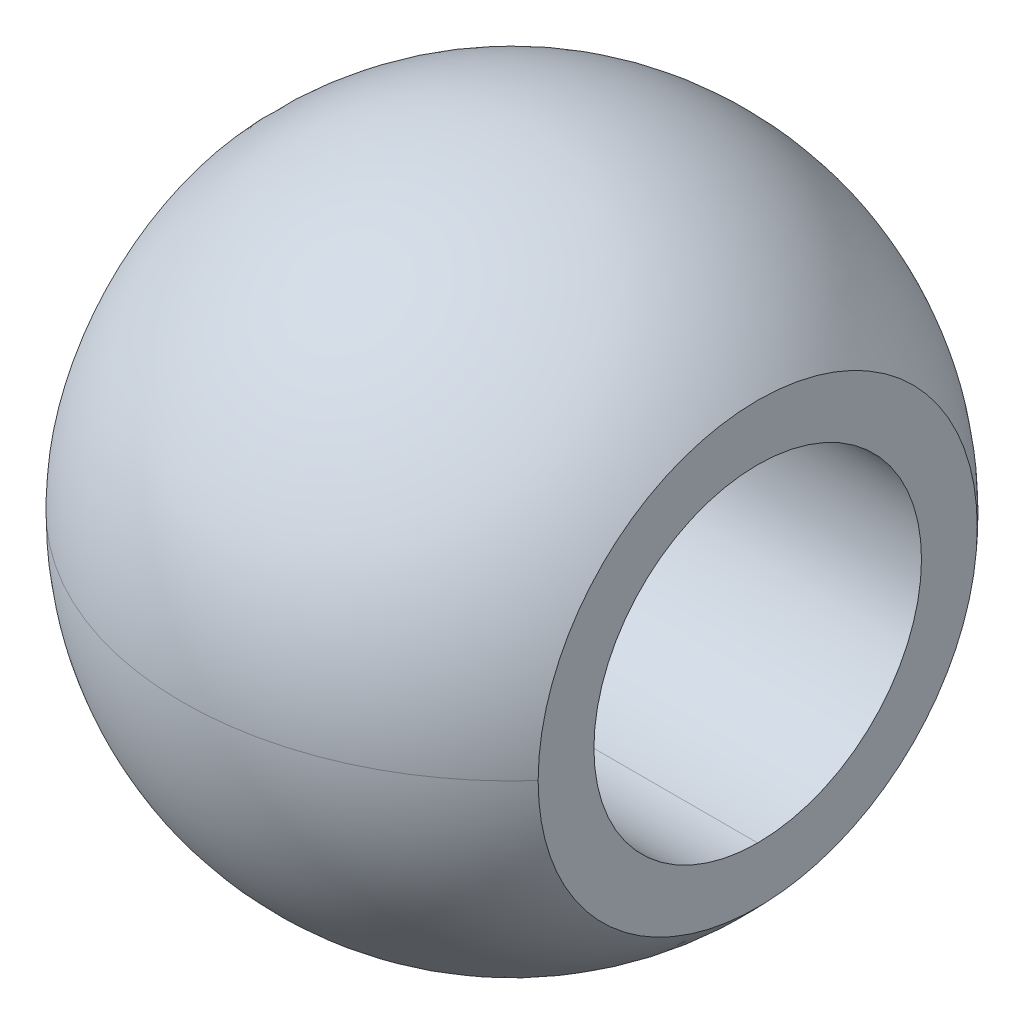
ISO-10303-21;
HEADER;
FILE_DESCRIPTION(('STEP AP214'),'2;1');
FILE_NAME('part.step','',(''),(''),'','','');
FILE_SCHEMA(('AUTOMOTIVE_DESIGN { 1 0 10303 214 1 1 1 1 }'));
ENDSEC;
DATA;
#1=APPLICATION_CONTEXT('core data for automotive mechanical design processes');
#2=APPLICATION_PROTOCOL_DEFINITION('international standard','automotive_design',2000,#1);
#3=PRODUCT_CONTEXT('',#1,'mechanical');
#4=PRODUCT('Part','Part','',(#3));
#5=PRODUCT_RELATED_PRODUCT_CATEGORY('part','',(#4));
#6=PRODUCT_DEFINITION_FORMATION('','',#4);
#7=PRODUCT_DEFINITION_CONTEXT('part definition',#1,'design');
#8=PRODUCT_DEFINITION('design','',#6,#7);
#9=PRODUCT_DEFINITION_SHAPE('','',#8);
#10=(LENGTH_UNIT() NAMED_UNIT(*) SI_UNIT(.MILLI.,.METRE.));
#11=(NAMED_UNIT(*) PLANE_ANGLE_UNIT() SI_UNIT($,.RADIAN.));
#12=(NAMED_UNIT(*) SI_UNIT($,.STERADIAN.) SOLID_ANGLE_UNIT());
#13=UNCERTAINTY_MEASURE_WITH_UNIT(LENGTH_MEASURE(1.E-05),#10,'distance_accuracy_value','');
#14=(GEOMETRIC_REPRESENTATION_CONTEXT(3) GLOBAL_UNCERTAINTY_ASSIGNED_CONTEXT((#13)) GLOBAL_UNIT_ASSIGNED_CONTEXT((#10,
#11,#12)) REPRESENTATION_CONTEXT('',''));
#15=CARTESIAN_POINT('',(0.,0.,0.));
#16=DIRECTION('',(0.,0.,1.));
#17=DIRECTION('',(1.,0.,0.));
#18=AXIS2_PLACEMENT_3D('',#15,#16,#17);
#19=CARTESIAN_POINT('',(0.,0.,0.));
#20=DIRECTION('',(-1.,0.,0.));
#21=DIRECTION('',(0.,0.,1.));
#22=AXIS2_PLACEMENT_3D('',#19,#20,#21);
#23=CYLINDRICAL_SURFACE('',#22,3.);
#24=CARTESIAN_POINT('',(-4.5,0.,0.));
#25=DIRECTION('',(-1.,0.,0.));
#26=DIRECTION('',(0.,0.,1.));
#27=AXIS2_PLACEMENT_3D('',#24,#25,#26);
#28=CIRCLE('',#27,3.);
#29=CARTESIAN_POINT('',(-4.5,3.,0.));
#30=VERTEX_POINT('',#29);
#31=CARTESIAN_POINT('',(-4.5,-3.,0.));
#32=VERTEX_POINT('',#31);
#33=EDGE_CURVE('E68',#30,#32,#28,.T.);
#34=ORIENTED_EDGE('',*,*,#33,.T.);
#35=DIRECTION('',(-1.,0.,0.));
#36=VECTOR('',#35,1.);
#37=CARTESIAN_POINT('',(0.,-3.,0.));
#38=LINE('',#37,#36);
#39=CARTESIAN_POINT('',(4.5,-3.,0.));
#40=VERTEX_POINT('',#39);
#41=EDGE_CURVE('E63',#32,#40,#38,.F.);
#42=ORIENTED_EDGE('',*,*,#41,.T.);
#43=CARTESIAN_POINT('',(4.5,0.,0.));
#44=DIRECTION('',(-1.,0.,0.));
#45=DIRECTION('',(0.,0.,1.));
#46=AXIS2_PLACEMENT_3D('',#43,#44,#45);
#47=CIRCLE('',#46,3.);
#48=CARTESIAN_POINT('',(4.5,3.,0.));
#49=VERTEX_POINT('',#48);
#50=EDGE_CURVE('E65',#40,#49,#47,.F.);
#51=ORIENTED_EDGE('',*,*,#50,.T.);
#52=DIRECTION('',(-1.,0.,0.));
#53=VECTOR('',#52,1.);
#54=CARTESIAN_POINT('',(0.,3.,0.));
#55=LINE('',#54,#53);
#56=EDGE_CURVE('E58',#49,#30,#55,.T.);
#57=ORIENTED_EDGE('',*,*,#56,.T.);
#58=EDGE_LOOP('',(#34,#42,#51,#57));
#59=FACE_BOUND('',#58,.T.);
#60=ADVANCED_FACE('F14',(#59),#23,.F.);
#61=CARTESIAN_POINT('',(0.,0.,0.));
#62=DIRECTION('',(-1.,0.,0.));
#63=DIRECTION('',(0.,0.,1.));
#64=AXIS2_PLACEMENT_3D('',#61,#62,#63);
#65=CYLINDRICAL_SURFACE('',#64,3.);
#66=CARTESIAN_POINT('',(4.5,0.,0.));
#67=DIRECTION('',(-1.,0.,0.));
#68=DIRECTION('',(0.,0.,1.));
#69=AXIS2_PLACEMENT_3D('',#66,#67,#68);
#70=CIRCLE('',#69,3.);
#71=EDGE_CURVE('E17',#49,#40,#70,.F.);
#72=ORIENTED_EDGE('',*,*,#71,.T.);
#73=ORIENTED_EDGE('',*,*,#41,.F.);
#74=CARTESIAN_POINT('',(-4.5,0.,0.));
#75=DIRECTION('',(-1.,0.,0.));
#76=DIRECTION('',(0.,0.,1.));
#77=AXIS2_PLACEMENT_3D('',#74,#75,#76);
#78=CIRCLE('',#77,3.);
#79=EDGE_CURVE('E154',#32,#30,#78,.T.);
#80=ORIENTED_EDGE('',*,*,#79,.T.);
#81=ORIENTED_EDGE('',*,*,#56,.F.);
#82=EDGE_LOOP('',(#72,#73,#80,#81));
#83=FACE_BOUND('',#82,.T.);
#84=ADVANCED_FACE('F71',(#83),#65,.F.);
#85=CARTESIAN_POINT('',(4.5,12.07,-12.07));
#86=DIRECTION('',(-1.,0.,0.));
#87=DIRECTION('',(0.,0.,1.));
#88=AXIS2_PLACEMENT_3D('',#85,#86,#87);
#89=PLANE('',#88);
#90=CARTESIAN_POINT('',(4.5,0.,4.02134616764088));
#91=CARTESIAN_POINT('',(4.5,0.11310688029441,4.02135700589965));
#92=CARTESIAN_POINT('',(4.5,0.22620862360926,4.01657423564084));
#93=CARTESIAN_POINT('',(4.5,0.451602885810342,3.99750534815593));
#94=CARTESIAN_POINT('',(4.5,0.563895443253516,3.98321968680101));
#95=CARTESIAN_POINT('',(4.5,0.786799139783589,3.94524322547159));
#96=CARTESIAN_POINT('',(4.5,0.89741148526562,3.92155954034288));
#97=CARTESIAN_POINT('',(4.5,1.11622089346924,3.86497914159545));
#98=CARTESIAN_POINT('',(4.5,1.22441798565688,3.83208254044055));
#99=CARTESIAN_POINT('',(4.5,1.54434242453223,3.71983911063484));
#100=CARTESIAN_POINT('',(4.5,1.75149364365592,3.6269231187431));
#101=CARTESIAN_POINT('',(4.5,2.14710423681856,3.40769375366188));
#102=CARTESIAN_POINT('',(4.5,2.33556689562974,3.28138626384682));
#103=CARTESIAN_POINT('',(4.5,2.68864347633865,2.99891708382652));
#104=CARTESIAN_POINT('',(4.5,2.85325763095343,2.84275568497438));
#105=CARTESIAN_POINT('',(4.5,3.15395693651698,2.50497964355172));
#106=CARTESIAN_POINT('',(4.5,3.29003650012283,2.32336002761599));
#107=CARTESIAN_POINT('',(4.5,3.52979320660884,1.93983393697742));
#108=CARTESIAN_POINT('',(4.5,3.63346400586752,1.73792350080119));
#109=CARTESIAN_POINT('',(4.5,3.80538192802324,1.31960348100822));
#110=CARTESIAN_POINT('',(4.5,3.87364979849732,1.10320247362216));
#111=CARTESIAN_POINT('',(4.5,3.95585906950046,0.737897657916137));
#112=CARTESIAN_POINT('',(4.5,3.98040189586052,0.591291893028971));
#113=CARTESIAN_POINT('',(4.5,4.0131432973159,0.296477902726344));
#114=CARTESIAN_POINT('',(4.5,4.02136504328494,0.148272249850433));
#115=CARTESIAN_POINT('',(4.5,4.02134616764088,0.));
#116=B_SPLINE_CURVE_WITH_KNOTS('',3,(#90,#91,#92,#93,#94,#95,#96,#97,#98,#99,#100,#101,#102,
#103,#104,#105,#106,#107,#108,#109,#110,#111,#112,#113,#114,#115),.UNSPECIFIED.,.F.,.F.,(4,2,2,
2,2,2,2,2,2,2,2,2,4),(0.,0.339210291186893,0.678404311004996,1.01734202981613,1.35627561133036,
2.03387015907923,2.7113453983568,3.38881402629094,4.06641518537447,4.74414889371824,
5.42148497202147,5.86657662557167,6.31103593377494),.UNSPECIFIED.);
#117=CARTESIAN_POINT('',(4.5,0.,4.02134616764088));
#118=VERTEX_POINT('',#117);
#119=CARTESIAN_POINT('',(4.5,4.02134616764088,0.));
#120=VERTEX_POINT('',#119);
#121=EDGE_CURVE('E74',#118,#120,#116,.T.);
#122=ORIENTED_EDGE('',*,*,#121,.F.);
#123=CARTESIAN_POINT('',(4.5,-9.22005527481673E-13,-4.02134616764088));
#124=CARTESIAN_POINT('',(4.5,-0.113101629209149,-4.02135832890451));
#125=CARTESIAN_POINT('',(4.5,-0.226201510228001,-4.01657515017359));
#126=CARTESIAN_POINT('',(4.5,-0.451592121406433,-3.99750594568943));
#127=CARTESIAN_POINT('',(4.5,-0.56388289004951,-3.98322037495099));
#128=CARTESIAN_POINT('',(4.5,-0.786782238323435,-3.94524755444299));
#129=CARTESIAN_POINT('',(4.5,-0.897391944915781,-3.92156692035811));
#130=CARTESIAN_POINT('',(4.5,-1.11622307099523,-3.86497625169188));
#131=CARTESIAN_POINT('',(4.5,-1.22444451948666,-3.83206632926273));
#132=CARTESIAN_POINT('',(4.5,-1.43776215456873,-3.75723901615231));
#133=CARTESIAN_POINT('',(4.5,-1.5428574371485,-3.7153190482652));
#134=CARTESIAN_POINT('',(4.5,-1.74918151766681,-3.62275832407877));
#135=CARTESIAN_POINT('',(4.5,-1.85040887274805,-3.57211435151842));
#136=CARTESIAN_POINT('',(4.5,-2.04817993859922,-3.46250754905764));
#137=CARTESIAN_POINT('',(4.5,-2.14472626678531,-3.40354944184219));
#138=CARTESIAN_POINT('',(4.5,-2.33254527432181,-3.27768843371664));
#139=CARTESIAN_POINT('',(4.5,-2.42381599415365,-3.21078260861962));
#140=CARTESIAN_POINT('',(4.5,-2.60036546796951,-3.06954386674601));
#141=CARTESIAN_POINT('',(4.5,-2.6856462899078,-2.99521353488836));
#142=CARTESIAN_POINT('',(4.5,-2.84967514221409,-2.8396057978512));
#143=CARTESIAN_POINT('',(4.5,-2.92842074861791,-2.7583258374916));
#144=CARTESIAN_POINT('',(4.5,-3.07876771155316,-2.58943881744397));
#145=CARTESIAN_POINT('',(4.5,-3.15037061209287,-2.50183313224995));
#146=CARTESIAN_POINT('',(4.5,-3.28596770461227,-2.32086829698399));
#147=CARTESIAN_POINT('',(4.5,-3.34995907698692,-2.22750703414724));
#148=CARTESIAN_POINT('',(4.5,-3.46982240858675,-2.03576406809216));
#149=CARTESIAN_POINT('',(4.5,-3.52569771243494,-1.93738445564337));
#150=CARTESIAN_POINT('',(4.5,-3.62898238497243,-1.73623129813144));
#151=CARTESIAN_POINT('',(4.5,-3.67638862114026,-1.63345614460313));
#152=CARTESIAN_POINT('',(4.5,-3.76235400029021,-1.42432216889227));
#153=CARTESIAN_POINT('',(4.5,-3.80091696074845,-1.31796491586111));
#154=CARTESIAN_POINT('',(4.5,-3.86896054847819,-1.10234064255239));
#155=CARTESIAN_POINT('',(4.5,-3.8984378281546,-0.993072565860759));
#156=CARTESIAN_POINT('',(4.5,-3.9480728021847,-0.772478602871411));
#157=CARTESIAN_POINT('',(4.5,-3.96823363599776,-0.661153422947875));
#158=CARTESIAN_POINT('',(4.5,-3.99911248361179,-0.437161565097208));
#159=CARTESIAN_POINT('',(4.49999999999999,-4.00982721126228,-0.32449443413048));
#160=CARTESIAN_POINT('',(4.50000000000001,-4.02172479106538,-0.0986750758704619));
#161=CARTESIAN_POINT('',(4.50000000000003,-4.02290908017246,0.0144770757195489));
#162=CARTESIAN_POINT('',(4.49999999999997,-4.01574114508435,0.240478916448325));
#163=CARTESIAN_POINT('',(4.4999999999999,-4.0073889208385,0.353328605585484));
#164=CARTESIAN_POINT('',(4.4999999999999,-3.98120518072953,0.577941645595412));
#165=CARTESIAN_POINT('',(4.49999999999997,-3.96337211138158,0.689704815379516));
#166=CARTESIAN_POINT('',(4.50000000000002,-3.91836039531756,0.911292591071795));
#167=CARTESIAN_POINT('',(4.5,-3.89118499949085,1.02111785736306));
#168=CARTESIAN_POINT('',(4.5,-3.82766914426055,1.2381277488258));
#169=CARTESIAN_POINT('',(4.50000000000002,-3.79132543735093,1.34531142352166));
#170=CARTESIAN_POINT('',(4.49999999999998,-3.70975125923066,1.55619652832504));
#171=CARTESIAN_POINT('',(4.49999999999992,-3.66452406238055,1.65989922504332));
#172=CARTESIAN_POINT('',(4.49999999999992,-3.56547625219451,1.86316697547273));
#173=CARTESIAN_POINT('',(4.49999999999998,-3.51165225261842,1.96273037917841));
#174=CARTESIAN_POINT('',(4.50000000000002,-3.39582787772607,2.15693201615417));
#175=CARTESIAN_POINT('',(4.5,-3.3338305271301,2.25157205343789));
#176=CARTESIAN_POINT('',(4.5,-3.20206360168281,2.43532328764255));
#177=CARTESIAN_POINT('',(4.50000000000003,-3.13229154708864,2.524432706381));
#178=CARTESIAN_POINT('',(4.49999999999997,-2.98551469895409,2.69642419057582));
#179=CARTESIAN_POINT('',(4.49999999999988,-2.90851258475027,2.77930854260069));
#180=CARTESIAN_POINT('',(4.49999999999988,-2.74778215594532,2.93831594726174));
#181=CARTESIAN_POINT('',(4.49999999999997,-2.664052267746,3.01443740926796));
#182=CARTESIAN_POINT('',(4.50000000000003,-2.49050941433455,3.15932917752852));
#183=CARTESIAN_POINT('',(4.50000000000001,-2.40069870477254,3.22810218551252));
#184=CARTESIAN_POINT('',(4.49999999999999,-2.21554097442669,3.35788530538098));
#185=CARTESIAN_POINT('',(4.5,-2.12019018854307,3.41889004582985));
#186=CARTESIAN_POINT('',(4.5,-1.92472296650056,3.53262616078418));
#187=CARTESIAN_POINT('',(4.5,-1.82460830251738,3.58536058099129));
#188=CARTESIAN_POINT('',(4.5,-1.62019226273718,3.68225588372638));
#189=CARTESIAN_POINT('',(4.5,-1.51588687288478,3.72640829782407));
#190=CARTESIAN_POINT('',(4.5,-1.3039636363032,3.80574565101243));
#191=CARTESIAN_POINT('',(4.5,-1.19634705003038,3.84093395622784));
#192=CARTESIAN_POINT('',(4.5,-0.978653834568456,3.90208038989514));
#193=CARTESIAN_POINT('',(4.5,-0.868580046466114,3.9280486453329));
#194=CARTESIAN_POINT('',(4.5,-0.646680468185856,3.97061488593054));
#195=CARTESIAN_POINT('',(4.5,-0.534855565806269,3.98721747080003));
#196=CARTESIAN_POINT('',(4.5,-0.352322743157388,4.00650515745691));
#197=CARTESIAN_POINT('',(4.5,-0.281907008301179,4.01207408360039));
#198=CARTESIAN_POINT('',(4.5,-0.140996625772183,4.01949192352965));
#199=CARTESIAN_POINT('',(4.5,-0.0705023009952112,4.0213469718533));
#200=CARTESIAN_POINT('',(4.5,0.,4.02134616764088));
#201=B_SPLINE_CURVE_WITH_KNOTS('',3,(#123,#124,#125,#126,#127,#128,#129,#130,#131,#132,#133,
#134,#135,#136,#137,#138,#139,#140,#141,#142,#143,#144,#145,#146,#147,#148,#149,#150,#151,#152,
#153,#154,#155,#156,#157,#158,#159,#160,#161,#162,#163,#164,#165,#166,#167,#168,#169,#170,#171,
#172,#173,#174,#175,#176,#177,#178,#179,#180,#181,#182,#183,#184,#185,#186,#187,#188,#189,#190,
#191,#192,#193,#194,#195,#196,#197,#198,#199,#200),.UNSPECIFIED.,.F.,.F.,(4,2,2,2,2,2,2,2,2,2,2,
2,2,2,2,2,2,2,2,2,2,2,2,2,2,2,2,2,2,2,2,2,2,2,2,2,2,2,4),(0.,0.339201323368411,
0.678386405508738,1.01733306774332,1.35627561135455,1.69531523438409,2.0344801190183,
2.37345311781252,2.71255122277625,3.05153167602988,3.39063730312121,3.72966946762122,
4.06882683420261,4.40784403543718,4.74698637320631,5.08598203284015,5.42510244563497,
5.76410849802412,6.10323243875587,6.44230524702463,6.78137805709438,7.12050644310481,
7.45951694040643,7.79864768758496,8.13765366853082,8.47679351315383,8.81580820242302,
9.15493133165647,9.49392927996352,9.83300675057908,10.171959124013,10.5111446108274,
10.8502048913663,11.1895980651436,11.5288636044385,11.8677553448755,12.206480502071,
12.4182973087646,12.6297639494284),.UNSPECIFIED.);
#202=CARTESIAN_POINT('',(4.5,-9.21571846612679E-13,-4.02134616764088));
#203=VERTEX_POINT('',#202);
#204=EDGE_CURVE('E151',#203,#118,#201,.T.);
#205=ORIENTED_EDGE('',*,*,#204,.F.);
#206=CARTESIAN_POINT('',(4.5,4.02134616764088,0.));
#207=CARTESIAN_POINT('',(4.5,4.02135700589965,-0.1131068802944));
#208=CARTESIAN_POINT('',(4.5,4.01657423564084,-0.226208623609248));
#209=CARTESIAN_POINT('',(4.5,3.99750534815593,-0.451602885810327));
#210=CARTESIAN_POINT('',(4.49999999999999,3.98321968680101,-0.563895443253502));
#211=CARTESIAN_POINT('',(4.5,3.94524322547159,-0.786799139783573));
#212=CARTESIAN_POINT('',(4.50000000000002,3.92155954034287,-0.897411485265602));
#213=CARTESIAN_POINT('',(4.49999999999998,3.86497914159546,-1.11622089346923));
#214=CARTESIAN_POINT('',(4.49999999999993,3.83208254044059,-1.22441798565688));
#215=CARTESIAN_POINT('',(4.49999999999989,3.71983911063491,-1.54434242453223));
#216=CARTESIAN_POINT('',(4.49999999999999,3.62692311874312,-1.7514936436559));
#217=CARTESIAN_POINT('',(4.50000000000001,3.40769375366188,-2.14710423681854));
#218=CARTESIAN_POINT('',(4.49999999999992,3.28138626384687,-2.33556689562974));
#219=CARTESIAN_POINT('',(4.4999999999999,2.99891708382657,-2.68864347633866));
#220=CARTESIAN_POINT('',(4.49999999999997,2.84275568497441,-2.85325763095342));
#221=CARTESIAN_POINT('',(4.50000000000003,2.50497964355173,-3.15395693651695));
#222=CARTESIAN_POINT('',(4.50000000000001,2.32336002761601,-3.29003650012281));
#223=CARTESIAN_POINT('',(4.49999999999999,1.93983393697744,-3.52979320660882));
#224=CARTESIAN_POINT('',(4.5,1.7379235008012,-3.63346400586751));
#225=CARTESIAN_POINT('',(4.5,1.31960348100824,-3.80538192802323));
#226=CARTESIAN_POINT('',(4.5,1.10320247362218,-3.87364979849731));
#227=CARTESIAN_POINT('',(4.5,0.737897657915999,-3.95585906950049));
#228=CARTESIAN_POINT('',(4.5,0.591291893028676,-3.98040189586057));
#229=CARTESIAN_POINT('',(4.5,0.296477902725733,-4.01314329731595));
#230=CARTESIAN_POINT('',(4.5,0.148272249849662,-4.02136504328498));
#231=CARTESIAN_POINT('',(4.5,-9.26342336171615E-13,-4.02134616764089));
#232=B_SPLINE_CURVE_WITH_KNOTS('',3,(#206,#207,#208,#209,#210,#211,#212,#213,#214,#215,#216,
#217,#218,#219,#220,#221,#222,#223,#224,#225,#226,#227,#228,#229,#230,#231),.UNSPECIFIED.,.F.,
.F.,(4,2,2,2,2,2,2,2,2,2,2,2,4),(0.,0.339210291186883,0.678404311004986,1.01734202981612,
1.35627561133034,2.03387015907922,2.71134539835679,3.38881402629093,4.06641518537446,
4.74414889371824,5.42148497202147,5.86657662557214,6.31103593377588),.UNSPECIFIED.);
#233=EDGE_CURVE('E76',#120,#203,#232,.T.);
#234=ORIENTED_EDGE('',*,*,#233,.F.);
#235=EDGE_LOOP('',(#122,#205,#234));
#236=FACE_BOUND('',#235,.T.);
#237=ORIENTED_EDGE('',*,*,#71,.F.);
#238=ORIENTED_EDGE('',*,*,#50,.F.);
#239=EDGE_LOOP('',(#237,#238));
#240=FACE_BOUND('',#239,.T.);
#241=ADVANCED_FACE('F73',(#236,#240),#89,.F.);
#242=CARTESIAN_POINT('',(0.,0.,0.));
#243=DIRECTION('',(0.,0.,-1.));
#244=DIRECTION('',(0.,1.,0.));
#245=AXIS2_PLACEMENT_3D('',#242,#243,#244);
#246=SPHERICAL_SURFACE('',#245,6.035);
#247=ORIENTED_EDGE('',*,*,#121,.T.);
#248=ORIENTED_EDGE('',*,*,#233,.T.);
#249=CARTESIAN_POINT('',(0.,0.,-6.035));
#250=CARTESIAN_POINT('',(0.105802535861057,-1.29956146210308E-13,-6.03500276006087));
#251=CARTESIAN_POINT('',(0.211604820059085,-2.59911983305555E-13,-6.03221779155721));
#252=CARTESIAN_POINT('',(0.422916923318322,-5.19464425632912E-13,-6.02109221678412));
#253=CARTESIAN_POINT('',(0.528426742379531,-6.49061030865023E-13,-6.01275161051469));
#254=CARTESIAN_POINT('',(0.738861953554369,-9.07536395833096E-13,-5.99053457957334));
#255=CARTESIAN_POINT('',(0.843787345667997,-1.03641515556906E-12,-5.97665815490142));
#256=CARTESIAN_POINT('',(1.05276357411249,-1.29309846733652E-12,-5.94340873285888));
#257=CARTESIAN_POINT('',(1.15681441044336,-1.42090301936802E-12,-5.92403573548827));
#258=CARTESIAN_POINT('',(1.36375375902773,-1.6750844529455E-12,-5.87984651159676));
#259=CARTESIAN_POINT('',(1.46664227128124,-1.80146133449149E-12,-5.85503028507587));
#260=CARTESIAN_POINT('',(1.6709724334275,-2.05243793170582E-12,-5.80002329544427));
#261=CARTESIAN_POINT('',(1.77241408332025,-2.17703764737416E-12,-5.76983253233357));
#262=CARTESIAN_POINT('',(1.97356997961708,-2.42411532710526E-12,-5.7041599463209));
#263=CARTESIAN_POINT('',(2.07328422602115,-2.54659329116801E-12,-5.66867812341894));
#264=CARTESIAN_POINT('',(2.27070955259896,-2.78908875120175E-12,-5.59252154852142));
#265=CARTESIAN_POINT('',(2.36842063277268,-2.90910624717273E-12,-5.55184679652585));
#266=CARTESIAN_POINT('',(2.561569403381,-3.14634885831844E-12,-5.46541684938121));
#267=CARTESIAN_POINT('',(2.65700709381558,-3.26357397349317E-12,-5.41966165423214));
#268=CARTESIAN_POINT('',(2.84534514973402,-3.49490763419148E-12,-5.32319735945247));
#269=CARTESIAN_POINT('',(2.93824551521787,-3.60901617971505E-12,-5.27248825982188));
#270=CARTESIAN_POINT('',(3.12125199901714,-3.83380112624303E-12,-5.16625639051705));
#271=CARTESIAN_POINT('',(3.21135811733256,-3.94447752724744E-12,-5.11073362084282));
#272=CARTESIAN_POINT('',(3.38852692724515,-4.16209212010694E-12,-4.995027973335));
#273=CARTESIAN_POINT('',(3.47558961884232,-4.26903031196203E-12,-4.93484509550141));
#274=CARTESIAN_POINT('',(3.64643075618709,-4.47887269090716E-12,-4.80998562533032));
#275=CARTESIAN_POINT('',(3.73020920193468,-4.5817768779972E-12,-4.74530903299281));
#276=CARTESIAN_POINT('',(3.89425032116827,-4.78326686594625E-12,-4.61164116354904));
#277=CARTESIAN_POINT('',(3.97451299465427,-4.88185266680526E-12,-4.54264988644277));
#278=CARTESIAN_POINT('',(4.13129998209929,-5.07443248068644E-12,-4.40054283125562));
#279=CARTESIAN_POINT('',(4.20782429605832,-5.16842649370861E-12,-4.32742705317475));
#280=CARTESIAN_POINT('',(4.35692524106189,-5.3515656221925E-12,-4.17727549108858));
#281=CARTESIAN_POINT('',(4.42950187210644,-5.44071073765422E-12,-4.10023970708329));
#282=CARTESIAN_POINT('',(4.5,-5.52730284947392E-12,-4.02134616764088));
#283=B_SPLINE_CURVE_WITH_KNOTS('',3,(#249,#250,#251,#252,#253,#254,#255,#256,#257,#258,#259,
#260,#261,#262,#263,#264,#265,#266,#267,#268,#269,#270,#271,#272,#273,#274,#275,#276,#277,#278,
#279,#280,#281,#282),.UNSPECIFIED.,.F.,.F.,(4,2,2,2,2,2,2,2,2,2,2,2,2,2,2,2,4),(0.,
0.317370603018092,0.634741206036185,0.952111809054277,1.26948241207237,1.58685301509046,
1.90422361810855,2.22159422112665,2.53896482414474,2.85633542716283,3.17370603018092,
3.49107663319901,3.80844723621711,4.1258178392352,4.44318844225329,4.76055904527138,
5.07792964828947),.UNSPECIFIED.);
#284=CARTESIAN_POINT('',(0.,0.,-6.035));
#285=VERTEX_POINT('',#284);
#286=EDGE_CURVE('E145',#285,#203,#283,.T.);
#287=ORIENTED_EDGE('',*,*,#286,.F.);
#288=CARTESIAN_POINT('',(0.,0.,0.));
#289=DIRECTION('',(-1.22853444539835E-12,1.,0.));
#290=DIRECTION('',(0.,0.,-1.));
#291=AXIS2_PLACEMENT_3D('',#288,#289,#290);
#292=CIRCLE('',#291,6.035);
#293=CARTESIAN_POINT('',(-4.5,-3.22433790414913E-12,-4.02134616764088));
#294=VERTEX_POINT('',#293);
#295=EDGE_CURVE('E147',#294,#285,#292,.F.);
#296=ORIENTED_EDGE('',*,*,#295,.F.);
#297=CARTESIAN_POINT('',(-4.5,-9.20270804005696E-13,-4.02134616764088));
#298=CARTESIAN_POINT('',(-4.5,0.113101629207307,-4.02135832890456));
#299=CARTESIAN_POINT('',(-4.5,0.226201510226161,-4.0165751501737));
#300=CARTESIAN_POINT('',(-4.5,0.451592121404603,-3.99750594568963));
#301=CARTESIAN_POINT('',(-4.5,0.563882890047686,-3.98322037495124));
#302=CARTESIAN_POINT('',(-4.5,0.786782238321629,-3.94524755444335));
#303=CARTESIAN_POINT('',(-4.5,0.897391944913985,-3.92156692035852));
#304=CARTESIAN_POINT('',(-4.5,1.11622307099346,-3.86497625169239));
#305=CARTESIAN_POINT('',(-4.5,1.2244445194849,-3.83206632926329));
#306=CARTESIAN_POINT('',(-4.5,1.437762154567,-3.75723901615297));
#307=CARTESIAN_POINT('',(-4.5,1.5428574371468,-3.71531904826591));
#308=CARTESIAN_POINT('',(-4.5,1.74918151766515,-3.62275832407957));
#309=CARTESIAN_POINT('',(-4.5,1.85040887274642,-3.57211435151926));
#310=CARTESIAN_POINT('',(-4.5,2.04817993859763,-3.46250754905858));
#311=CARTESIAN_POINT('',(-4.5,2.14472626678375,-3.40354944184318));
#312=CARTESIAN_POINT('',(-4.5,2.3325452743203,-3.27768843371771));
#313=CARTESIAN_POINT('',(-4.5,2.42381599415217,-3.21078260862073));
#314=CARTESIAN_POINT('',(-4.5,2.6003654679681,-3.0695438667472));
#315=CARTESIAN_POINT('',(-4.5,2.68564628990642,-2.9952135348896));
#316=CARTESIAN_POINT('',(-4.5,2.84967514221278,-2.83960579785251));
#317=CARTESIAN_POINT('',(-4.5,2.92842074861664,-2.75832583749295));
#318=CARTESIAN_POINT('',(-4.5,3.07876771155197,-2.58943881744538));
#319=CARTESIAN_POINT('',(-4.5,3.15037061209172,-2.5018331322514));
#320=CARTESIAN_POINT('',(-4.5,3.2859677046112,-2.3208682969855));
#321=CARTESIAN_POINT('',(-4.5,3.3499590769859,-2.22750703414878));
#322=CARTESIAN_POINT('',(-4.5,3.46982240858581,-2.03576406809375));
#323=CARTESIAN_POINT('',(-4.5,3.52569771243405,-1.93738445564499));
#324=CARTESIAN_POINT('',(-4.5,3.62898238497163,-1.73623129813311));
#325=CARTESIAN_POINT('',(-4.5,3.67638862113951,-1.63345614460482));
#326=CARTESIAN_POINT('',(-4.5,3.76235400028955,-1.424322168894));
#327=CARTESIAN_POINT('',(-4.5,3.80091696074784,-1.31796491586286));
#328=CARTESIAN_POINT('',(-4.5,3.86896054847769,-1.10234064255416));
#329=CARTESIAN_POINT('',(-4.5,3.89843782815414,-0.993072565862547));
#330=CARTESIAN_POINT('',(-4.5,3.94807280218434,-0.772478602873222));
#331=CARTESIAN_POINT('',(-4.5,3.96823363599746,-0.661153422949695));
#332=CARTESIAN_POINT('',(-4.5,3.99911248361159,-0.437161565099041));
#333=CARTESIAN_POINT('',(-4.49999999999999,4.00982721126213,-0.324494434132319));
#334=CARTESIAN_POINT('',(-4.50000000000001,4.02172479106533,-0.0986750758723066));
#335=CARTESIAN_POINT('',(-4.50000000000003,4.02290908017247,0.0144770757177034));
#336=CARTESIAN_POINT('',(-4.49999999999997,4.01574114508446,0.240478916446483));
#337=CARTESIAN_POINT('',(-4.49999999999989,4.00738892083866,0.353328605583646));
#338=CARTESIAN_POINT('',(-4.4999999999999,3.9812051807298,0.577941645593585));
#339=CARTESIAN_POINT('',(-4.49999999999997,3.9633721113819,0.689704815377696));
#340=CARTESIAN_POINT('',(-4.50000000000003,3.91836039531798,0.911292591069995));
#341=CARTESIAN_POINT('',(-4.5,3.89118499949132,1.02111785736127));
#342=CARTESIAN_POINT('',(-4.5,3.82766914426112,1.23812774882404));
#343=CARTESIAN_POINT('',(-4.50000000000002,3.79132543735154,1.34531142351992));
#344=CARTESIAN_POINT('',(-4.49999999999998,3.70975125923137,1.55619652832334));
#345=CARTESIAN_POINT('',(-4.49999999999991,3.66452406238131,1.65989922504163));
#346=CARTESIAN_POINT('',(-4.49999999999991,3.56547625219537,1.86316697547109));
#347=CARTESIAN_POINT('',(-4.49999999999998,3.51165225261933,1.9627303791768));
#348=CARTESIAN_POINT('',(-4.50000000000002,3.39582787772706,2.15693201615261));
#349=CARTESIAN_POINT('',(-4.5,3.33383052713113,2.25157205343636));
#350=CARTESIAN_POINT('',(-4.5,3.20206360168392,2.43532328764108));
#351=CARTESIAN_POINT('',(-4.50000000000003,3.1322915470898,2.52443270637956));
#352=CARTESIAN_POINT('',(-4.49999999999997,2.98551469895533,2.69642419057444));
#353=CARTESIAN_POINT('',(-4.49999999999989,2.90851258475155,2.77930854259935));
#354=CARTESIAN_POINT('',(-4.49999999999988,2.74778215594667,2.93831594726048));
#355=CARTESIAN_POINT('',(-4.49999999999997,2.66405226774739,3.01443740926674));
#356=CARTESIAN_POINT('',(-4.50000000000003,2.490509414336,3.15932917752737));
#357=CARTESIAN_POINT('',(-4.50000000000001,2.40069870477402,3.22810218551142));
#358=CARTESIAN_POINT('',(-4.49999999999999,2.21554097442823,3.35788530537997));
#359=CARTESIAN_POINT('',(-4.5,2.12019018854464,3.41889004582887));
#360=CARTESIAN_POINT('',(-4.5,1.92472296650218,3.5326261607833));
#361=CARTESIAN_POINT('',(-4.5,1.82460830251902,3.58536058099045));
#362=CARTESIAN_POINT('',(-4.5,1.62019226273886,3.68225588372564));
#363=CARTESIAN_POINT('',(-4.5,1.51588687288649,3.72640829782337));
#364=CARTESIAN_POINT('',(-4.5,1.30396363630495,3.80574565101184));
#365=CARTESIAN_POINT('',(-4.5,1.19634705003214,3.84093395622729));
#366=CARTESIAN_POINT('',(-4.5,0.978653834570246,3.90208038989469));
#367=CARTESIAN_POINT('',(-4.5,0.868580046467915,3.9280486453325));
#368=CARTESIAN_POINT('',(-4.5,0.646680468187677,3.97061488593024));
#369=CARTESIAN_POINT('',(-4.5,0.534855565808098,3.98721747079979));
#370=CARTESIAN_POINT('',(-4.5,0.35232274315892,4.00650515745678));
#371=CARTESIAN_POINT('',(-4.5,0.281907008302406,4.01207408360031));
#372=CARTESIAN_POINT('',(-4.5,0.140996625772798,4.01949192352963));
#373=CARTESIAN_POINT('',(-4.5,0.0705023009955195,4.0213469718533));
#374=CARTESIAN_POINT('',(-4.5,0.,4.02134616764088));
#375=B_SPLINE_CURVE_WITH_KNOTS('',3,(#297,#298,#299,#300,#301,#302,#303,#304,#305,#306,#307,
#308,#309,#310,#311,#312,#313,#314,#315,#316,#317,#318,#319,#320,#321,#322,#323,#324,#325,#326,
#327,#328,#329,#330,#331,#332,#333,#334,#335,#336,#337,#338,#339,#340,#341,#342,#343,#344,#345,
#346,#347,#348,#349,#350,#351,#352,#353,#354,#355,#356,#357,#358,#359,#360,#361,#362,#363,#364,
#365,#366,#367,#368,#369,#370,#371,#372,#373,#374),.UNSPECIFIED.,.F.,.F.,(4,2,2,2,2,2,2,2,2,2,2,
2,2,2,2,2,2,2,2,2,2,2,2,2,2,2,2,2,2,2,2,2,2,2,2,2,2,2,4),(0.,0.339201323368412,
0.678386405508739,1.01733306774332,1.35627561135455,1.69531523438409,2.0344801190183,
2.37345311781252,2.71255122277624,3.05153167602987,3.39063730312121,3.72966946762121,
4.0688268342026,4.40784403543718,4.74698637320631,5.08598203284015,5.42510244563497,
5.76410849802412,6.10323243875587,6.44230524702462,6.78137805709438,7.12050644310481,
7.45951694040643,7.79864768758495,8.13765366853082,8.47679351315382,8.81580820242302,
9.15493133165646,9.49392927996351,9.83300675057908,10.171959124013,10.5111446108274,
10.8502048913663,11.1895980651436,11.5288636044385,11.8677553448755,12.206480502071,
12.4182973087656,12.6297639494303),.UNSPECIFIED.);
#376=CARTESIAN_POINT('',(-4.5,0.,4.02134616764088));
#377=VERTEX_POINT('',#376);
#378=EDGE_CURVE('E152',#294,#377,#375,.T.);
#379=ORIENTED_EDGE('',*,*,#378,.T.);
#380=CARTESIAN_POINT('',(0.,0.,6.035));
#381=CARTESIAN_POINT('',(-0.105802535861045,0.,6.03500276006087));
#382=CARTESIAN_POINT('',(-0.211604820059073,0.,6.03221779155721));
#383=CARTESIAN_POINT('',(-0.422916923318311,0.,6.02109221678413));
#384=CARTESIAN_POINT('',(-0.528426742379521,0.,6.0127516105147));
#385=CARTESIAN_POINT('',(-0.738861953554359,0.,5.99053457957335));
#386=CARTESIAN_POINT('',(-0.843787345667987,0.,5.97665815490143));
#387=CARTESIAN_POINT('',(-1.05276357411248,0.,5.94340873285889));
#388=CARTESIAN_POINT('',(-1.15681441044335,0.,5.92403573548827));
#389=CARTESIAN_POINT('',(-1.36375375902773,0.,5.87984651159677));
#390=CARTESIAN_POINT('',(-1.46664227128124,0.,5.85503028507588));
#391=CARTESIAN_POINT('',(-1.67097243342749,0.,5.80002329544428));
#392=CARTESIAN_POINT('',(-1.77241408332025,0.,5.76983253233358));
#393=CARTESIAN_POINT('',(-1.97356997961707,0.,5.70415994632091));
#394=CARTESIAN_POINT('',(-2.07328422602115,0.,5.66867812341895));
#395=CARTESIAN_POINT('',(-2.27070955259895,0.,5.59252154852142));
#396=CARTESIAN_POINT('',(-2.36842063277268,0.,5.55184679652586));
#397=CARTESIAN_POINT('',(-2.56156940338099,0.,5.46541684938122));
#398=CARTESIAN_POINT('',(-2.65700709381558,0.,5.41966165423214));
#399=CARTESIAN_POINT('',(-2.84534514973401,0.,5.32319735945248));
#400=CARTESIAN_POINT('',(-2.93824551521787,0.,5.27248825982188));
#401=CARTESIAN_POINT('',(-3.12125199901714,0.,5.16625639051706));
#402=CARTESIAN_POINT('',(-3.21135811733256,0.,5.11073362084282));
#403=CARTESIAN_POINT('',(-3.38852692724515,0.,4.99502797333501));
#404=CARTESIAN_POINT('',(-3.47558961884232,0.,4.93484509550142));
#405=CARTESIAN_POINT('',(-3.64643075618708,0.,4.80998562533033));
#406=CARTESIAN_POINT('',(-3.73020920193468,0.,4.74530903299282));
#407=CARTESIAN_POINT('',(-3.89425032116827,0.,4.61164116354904));
#408=CARTESIAN_POINT('',(-3.97451299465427,0.,4.54264988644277));
#409=CARTESIAN_POINT('',(-4.13129998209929,0.,4.40054283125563));
#410=CARTESIAN_POINT('',(-4.20782429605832,0.,4.32742705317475));
#411=CARTESIAN_POINT('',(-4.35692524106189,0.,4.17727549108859));
#412=CARTESIAN_POINT('',(-4.42950187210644,0.,4.10023970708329));
#413=CARTESIAN_POINT('',(-4.5,0.,4.02134616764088));
#414=B_SPLINE_CURVE_WITH_KNOTS('',3,(#380,#381,#382,#383,#384,#385,#386,#387,#388,#389,#390,
#391,#392,#393,#394,#395,#396,#397,#398,#399,#400,#401,#402,#403,#404,#405,#406,#407,#408,#409,
#410,#411,#412,#413),.UNSPECIFIED.,.F.,.F.,(4,2,2,2,2,2,2,2,2,2,2,2,2,2,2,2,4),(0.,
0.317370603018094,0.634741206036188,0.952111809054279,1.26948241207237,1.58685301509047,
1.90422361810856,2.22159422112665,2.53896482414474,2.85633542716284,3.17370603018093,
3.49107663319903,3.80844723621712,4.12581783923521,4.4431884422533,4.7605590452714,
5.07792964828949),.UNSPECIFIED.);
#415=CARTESIAN_POINT('',(0.,0.,6.035));
#416=VERTEX_POINT('',#415);
#417=EDGE_CURVE('E113',#416,#377,#414,.T.);
#418=ORIENTED_EDGE('',*,*,#417,.F.);
#419=CARTESIAN_POINT('',(0.,0.,0.));
#420=DIRECTION('',(0.,-1.,0.));
#421=DIRECTION('',(0.,0.,-1.));
#422=AXIS2_PLACEMENT_3D('',#419,#420,#421);
#423=CIRCLE('',#422,6.035);
#424=EDGE_CURVE('E179',#118,#416,#423,.T.);
#425=ORIENTED_EDGE('',*,*,#424,.F.);
#426=EDGE_LOOP('',(#247,#248,#287,#296,#379,#418,#425));
#427=FACE_BOUND('',#426,.T.);
#428=ADVANCED_FACE('F92',(#427),#246,.T.);
#429=CARTESIAN_POINT('',(-4.5,12.07,12.07));
#430=DIRECTION('',(1.,0.,0.));
#431=DIRECTION('',(0.,0.,-1.));
#432=AXIS2_PLACEMENT_3D('',#429,#430,#431);
#433=PLANE('',#432);
#434=CARTESIAN_POINT('',(-4.5,0.,4.02134616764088));
#435=CARTESIAN_POINT('',(-4.5,-0.113106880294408,4.02135700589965));
#436=CARTESIAN_POINT('',(-4.5,-0.226208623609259,4.01657423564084));
#437=CARTESIAN_POINT('',(-4.5,-0.45160288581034,3.99750534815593));
#438=CARTESIAN_POINT('',(-4.5,-0.563895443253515,3.98321968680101));
#439=CARTESIAN_POINT('',(-4.5,-0.786799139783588,3.94524322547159));
#440=CARTESIAN_POINT('',(-4.5,-0.89741148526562,3.92155954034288));
#441=CARTESIAN_POINT('',(-4.5,-1.11622089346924,3.86497914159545));
#442=CARTESIAN_POINT('',(-4.5,-1.22441798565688,3.83208254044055));
#443=CARTESIAN_POINT('',(-4.5,-1.54434242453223,3.71983911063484));
#444=CARTESIAN_POINT('',(-4.5,-1.75149364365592,3.6269231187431));
#445=CARTESIAN_POINT('',(-4.5,-2.14710423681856,3.40769375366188));
#446=CARTESIAN_POINT('',(-4.5,-2.33556689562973,3.28138626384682));
#447=CARTESIAN_POINT('',(-4.5,-2.68864347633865,2.99891708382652));
#448=CARTESIAN_POINT('',(-4.5,-2.85325763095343,2.84275568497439));
#449=CARTESIAN_POINT('',(-4.5,-3.15395693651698,2.50497964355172));
#450=CARTESIAN_POINT('',(-4.5,-3.29003650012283,2.32336002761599));
#451=CARTESIAN_POINT('',(-4.5,-3.52979320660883,1.93983393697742));
#452=CARTESIAN_POINT('',(-4.5,-3.63346400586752,1.73792350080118));
#453=CARTESIAN_POINT('',(-4.5,-3.80538192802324,1.31960348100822));
#454=CARTESIAN_POINT('',(-4.5,-3.87364979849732,1.10320247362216));
#455=CARTESIAN_POINT('',(-4.5,-3.95585906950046,0.737897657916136));
#456=CARTESIAN_POINT('',(-4.5,-3.98040189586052,0.591291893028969));
#457=CARTESIAN_POINT('',(-4.5,-4.0131432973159,0.296477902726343));
#458=CARTESIAN_POINT('',(-4.5,-4.02136504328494,0.148272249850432));
#459=CARTESIAN_POINT('',(-4.5,-4.02134616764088,0.));
#460=B_SPLINE_CURVE_WITH_KNOTS('',3,(#434,#435,#436,#437,#438,#439,#440,#441,#442,#443,#444,
#445,#446,#447,#448,#449,#450,#451,#452,#453,#454,#455,#456,#457,#458,#459),.UNSPECIFIED.,.F.,
.F.,(4,2,2,2,2,2,2,2,2,2,2,2,4),(0.,0.339210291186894,0.678404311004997,1.01734202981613,
1.35627561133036,2.03387015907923,2.7113453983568,3.38881402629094,4.06641518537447,
4.74414889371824,5.42148497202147,5.86657662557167,6.31103593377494),.UNSPECIFIED.);
#461=CARTESIAN_POINT('',(-4.5,-4.02134616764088,0.));
#462=VERTEX_POINT('',#461);
#463=EDGE_CURVE('E23',#377,#462,#460,.T.);
#464=ORIENTED_EDGE('',*,*,#463,.F.);
#465=ORIENTED_EDGE('',*,*,#378,.F.);
#466=CARTESIAN_POINT('',(-4.5,-4.02134616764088,0.));
#467=CARTESIAN_POINT('',(-4.5,-4.02135700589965,-0.113106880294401));
#468=CARTESIAN_POINT('',(-4.5,-4.01657423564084,-0.226208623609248));
#469=CARTESIAN_POINT('',(-4.5,-3.99750534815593,-0.451602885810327));
#470=CARTESIAN_POINT('',(-4.49999999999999,-3.98321968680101,-0.563895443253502));
#471=CARTESIAN_POINT('',(-4.5,-3.94524322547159,-0.786799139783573));
#472=CARTESIAN_POINT('',(-4.50000000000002,-3.92155954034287,-0.897411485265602));
#473=CARTESIAN_POINT('',(-4.49999999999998,-3.86497914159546,-1.11622089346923));
#474=CARTESIAN_POINT('',(-4.49999999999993,-3.83208254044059,-1.22441798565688));
#475=CARTESIAN_POINT('',(-4.49999999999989,-3.71983911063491,-1.54434242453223));
#476=CARTESIAN_POINT('',(-4.49999999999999,-3.62692311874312,-1.7514936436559));
#477=CARTESIAN_POINT('',(-4.50000000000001,-3.40769375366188,-2.14710423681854));
#478=CARTESIAN_POINT('',(-4.49999999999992,-3.28138626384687,-2.33556689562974));
#479=CARTESIAN_POINT('',(-4.4999999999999,-2.99891708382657,-2.68864347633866));
#480=CARTESIAN_POINT('',(-4.49999999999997,-2.84275568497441,-2.85325763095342));
#481=CARTESIAN_POINT('',(-4.50000000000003,-2.50497964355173,-3.15395693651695));
#482=CARTESIAN_POINT('',(-4.50000000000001,-2.323360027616,-3.29003650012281));
#483=CARTESIAN_POINT('',(-4.49999999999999,-1.93983393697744,-3.52979320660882));
#484=CARTESIAN_POINT('',(-4.5,-1.7379235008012,-3.63346400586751));
#485=CARTESIAN_POINT('',(-4.5,-1.31960348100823,-3.80538192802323));
#486=CARTESIAN_POINT('',(-4.5,-1.10320247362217,-3.87364979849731));
#487=CARTESIAN_POINT('',(-4.5,-0.737897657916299,-3.95585906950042));
#488=CARTESIAN_POINT('',(-4.5,-0.591291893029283,-3.98040189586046));
#489=CARTESIAN_POINT('',(-4.5,-0.296477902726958,-4.01314329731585));
#490=CARTESIAN_POINT('',(-4.5,-0.148272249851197,-4.02136504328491));
#491=CARTESIAN_POINT('',(-4.5,-9.15933995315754E-13,-4.02134616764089));
#492=B_SPLINE_CURVE_WITH_KNOTS('',3,(#466,#467,#468,#469,#470,#471,#472,#473,#474,#475,#476,
#477,#478,#479,#480,#481,#482,#483,#484,#485,#486,#487,#488,#489,#490,#491),.UNSPECIFIED.,.F.,
.F.,(4,2,2,2,2,2,2,2,2,2,2,2,4),(0.,0.339210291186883,0.678404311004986,1.01734202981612,
1.35627561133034,2.03387015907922,2.71134539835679,3.38881402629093,4.06641518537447,
4.74414889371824,5.42148497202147,5.86657662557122,6.31103593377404),.UNSPECIFIED.);
#493=EDGE_CURVE('E9',#462,#294,#492,.T.);
#494=ORIENTED_EDGE('',*,*,#493,.F.);
#495=EDGE_LOOP('',(#464,#465,#494));
#496=FACE_BOUND('',#495,.T.);
#497=ORIENTED_EDGE('',*,*,#33,.F.);
#498=ORIENTED_EDGE('',*,*,#79,.F.);
#499=EDGE_LOOP('',(#497,#498));
#500=FACE_BOUND('',#499,.T.);
#501=ADVANCED_FACE('F97',(#496,#500),#433,.F.);
#502=CARTESIAN_POINT('',(0.,0.,0.));
#503=DIRECTION('',(0.,0.,-1.));
#504=DIRECTION('',(0.,1.,0.));
#505=AXIS2_PLACEMENT_3D('',#502,#503,#504);
#506=SPHERICAL_SURFACE('',#505,6.035);
#507=ORIENTED_EDGE('',*,*,#463,.T.);
#508=ORIENTED_EDGE('',*,*,#493,.T.);
#509=ORIENTED_EDGE('',*,*,#295,.T.);
#510=ORIENTED_EDGE('',*,*,#286,.T.);
#511=ORIENTED_EDGE('',*,*,#204,.T.);
#512=ORIENTED_EDGE('',*,*,#424,.T.);
#513=ORIENTED_EDGE('',*,*,#417,.T.);
#514=EDGE_LOOP('',(#507,#508,#509,#510,#511,#512,#513));
#515=FACE_BOUND('',#514,.T.);
#516=ADVANCED_FACE('F130',(#515),#506,.T.);
#517=CLOSED_SHELL('',(#60,#84,#241,#428,#501,#516));
#518=MANIFOLD_SOLID_BREP('B1',#517);
#519=ADVANCED_BREP_SHAPE_REPRESENTATION('',(#18,#518),#14);
#520=SHAPE_DEFINITION_REPRESENTATION(#9,#519);
ENDSEC;
END-ISO-10303-21;
